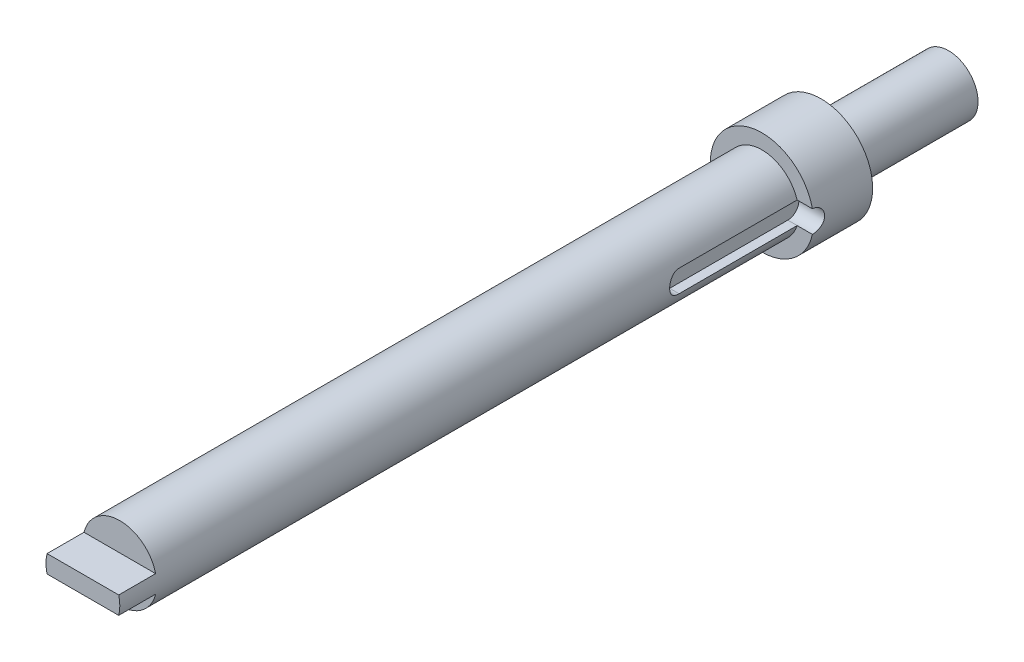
from build123d import *
from build123d.topology import SkipClean

# Parameters (mm, degrees)
SKETCH3_R               = 7.9375
BOSS_EXTRUDE1_DEPTH     = 138.1125
SKETCH5_R               = 11.1125
BOSS_EXTRUDE2_DEPTH     = 12.7
CUT_EXTRUDE2_DEPTH      = 140.862263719
CUT_EXTRUDE2_DEPTH_BACK = 2.38125
SKETCH9_R               = 6.35
BOSS_EXTRUDE3_DEPTH     = 27.432
BOSS_EXTRUDE4_DEPTH     = 7.9375


with BuildPart() as part:
    # Sketch3 → Boss-Extrude1 (new body)
    with BuildSketch(Plane.XY):
        Circle(SKETCH3_R)
    extrude(amount=BOSS_EXTRUDE1_DEPTH)

    # Sketch5 → Boss-Extrude2 (add)
    with BuildSketch(Plane(origin=(0, 0, 0), x_dir=(-1, 0, 0), z_dir=(0, 0, -1))):
        Circle(SKETCH5_R)
    extrude(amount=BOSS_EXTRUDE2_DEPTH)

    # Sketch8 → Cut-Extrude2 (cut, two sides: drawn at the far end of the back side and taken through both)
    with BuildSketch(Plane(origin=(7.9375, 0, 0), x_dir=(0, 0, -1), z_dir=(1, 0, 0)).offset(-CUT_EXTRUDE2_DEPTH_BACK)):
        with BuildLine():
            Line((-25.4, 2.38125), (0, 2.38125))
            ThreePointArc((0, 2.38125), (2.38125, 0), (0, -2.38125))
            Line((0, -2.38125), (-25.4, -2.38125))
            ThreePointArc((-25.4, -2.38125), (-27.78125, 0), (-25.4, 2.38125))
        make_face()
    extrude(amount=CUT_EXTRUDE2_DEPTH + CUT_EXTRUDE2_DEPTH_BACK, mode=Mode.SUBTRACT)

    # Sketch9 → Boss-Extrude3 (add)
    with BuildSketch(Plane(origin=(0, 0, -12.7), x_dir=(-1, 0, 0), z_dir=(0, 0, -1))):
        Circle(SKETCH9_R)
    extrude(amount=BOSS_EXTRUDE3_DEPTH)

    # Sketch10 → Boss-Extrude4 (add)
    with SkipClean():  # the faces are left unmerged after this step: merging them gives an invalid solid
        with BuildSketch(Plane.XY.offset(138.1125)):
            with BuildLine():
                Line((-7.705509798, 1.905), (7.705509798, 1.905))
                ThreePointArc((7.705509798, 1.905), (7.9375, 0), (7.705509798, -1.905))
                Line((7.705509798, -1.905), (-7.705509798, -1.905))
                ThreePointArc((-7.705509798, -1.905), (-7.9375, 0), (-7.705509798, 1.905))
            make_face()
        extrude(amount=BOSS_EXTRUDE4_DEPTH)


solid = part.part
